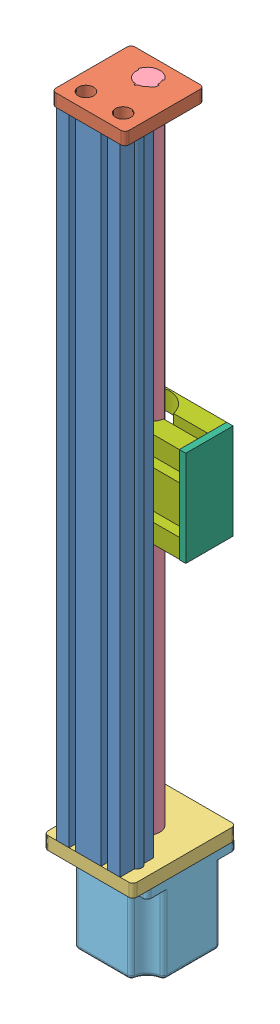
SolidWorks assembly 300mm Rail Assembly.SLDASM, configuration - (file format 12000). Lengths in mm.
Overall size (78.23 468.57 64.85).
8 component instances, 7 part files, 22 mates.
Components (placement in the parent):
- Base-2: Base.SLDPRT [-] at (-95.4137 -223.3019 406.9218) size (43.43 398.46 21.08)
- Free End-1: Free End.SLDPRT [-] at (-52.4877 183.0346 406.9218) x (-1 0 0) z (0 -1 0) size (45.97 49.78 7.87)
- Motor Mount-1: Motor Mount.SLDPRT [-] at (-103.4147 -223.3019 342.1518) x (1 0 0) z (0 -1 0) size (55.88 64.77 8.13)
- Ballscrew-1: Ballscrew.SLDPRT [-] at (-75.4747 183.0346 370.0156) x (-0.837169 0 -0.546944) z (0 -1 0) size (16 16 414.34)
- Motor-1: Motor.SLDPRT [-] at (-103.4147 -285.5319 397.9556) x (1 0 0) z (0 1 0) size (55.88 55.88 73.15)
- Carriage End-1: Carriage End.SLDPRT [-] at (-40.4227 -54.1697 355.1566) x (0 1 0) z (1 0 0) size (59.94 29.72 4.06)
- Carriage End-3: Carriage End.SLDPRT [-] at (-110.5267 5.7743 355.1566) x (0 -1 0) z (-1 0 0) size (59.94 29.72 4.06)
- Carriage1-1: Carriage1.SLDPRT [-] at (-40.4227 -53.9157 384.8746) x (0 1 0) z (-1 0 0) size (59.69 29.72 70.1)
Mates (geometry in assembly coordinates):
- Coincident1: coincident anti-aligned: plane of Base-2 through (-94.1437 175.1606 394.9838) normal (0 1 0); plane of Free End-1 through (-52.4877 175.1606 406.9218) normal (0 -1 0)
- Parallel1: parallel aligned: plane of Base-2 through (-55.5357 175.1606 392.213) normal (1 0 0); plane of Free End-1
- Distance3: distance = 3.048 mm aligned: plane of Base-2 through (-95.4137 175.1606 392.213) normal (-1 0 0); plane of Free End-1 through (-52.4877 175.1606 406.9218) normal (1 0 0)
- Coincident6: coincident anti-aligned: plane of Base-2 through (-94.1437 -223.3019 394.9838) normal (0 -1 0); plane of Motor Mount-1 through (-103.4147 -223.3019 342.1518) normal (0 1 0)
- Coincident7: coincident aligned: plane of Base-2 through (-83.4757 175.1606 406.9218) normal (0 0 1); plane of Motor Mount-1 through (-103.4147 -231.4299 406.9218) normal (0 0 1)
- Distance4: distance = 8.001 mm aligned: plane of Base-2 through (-55.5357 175.1606 392.213) normal (1 0 0); plane of Motor Mount-1 through (-47.5347 -231.4299 342.1518) normal (1 0 0)
- Coincident10: coincident aligned: plane of Free End-1 through (-52.4877 183.0346 406.9218) normal (0 1 0); plane of Ballscrew-1 through (-75.4747 183.0346 370.0156) normal (0 1 0)
- Coincident11: coincident aligned: plane of Base-2 through (-83.4757 175.1606 406.9218) normal (0 0 1); plane of Free End-1 through (-52.4877 175.1606 406.9218) normal (0 0 1)
- Distance5: distance = 3.048 mm aligned: plane of Free End-1 through (-98.4617 175.1606 406.9218) normal (-1 0 0); plane of Base-2 through (-95.4137 175.1606 392.213) normal (-1 0 0)
- Concentric1: concentric anti-aligned: cylinder of Free End-1 through (-75.4747 183.0346 370.0156) axis (0 -1 0) radius 6.985; cylinder of Ballscrew-1 through (-75.4747 -231.3029 370.0156) axis (0 1 0) radius 8.001
- Coincident13: coincident anti-aligned: plane of Motor Mount-1 through (-103.4147 -231.4299 342.1518) normal (0 -1 0); plane of Motor-1 through (-103.4147 -231.4299 342.0756) normal (0 1 0)
- Concentric2: concentric anti-aligned: cylinder of Ballscrew-1 through (-75.4747 -231.3029 370.0156) axis (0 1 0) radius 8.001; cylinder of Motor-1 through (-75.4747 -212.3799 370.0156) axis (0 -1 0) radius 3.175
- Concentric5: concentric anti-aligned: cylinder of Ballscrew-1 through (-75.4747 -231.3029 370.0156) axis (0 1 0) radius 8.001; cylinder of Carriage1-1 through (-75.4747 5.7743 370.0156) axis (0 -1 0) radius 13.97
- Parallel5: parallel anti-aligned: plane of Base-2 through (-83.4757 175.1606 385.8398) normal (0 0 -1); plane of Carriage1-1 through (-110.5267 -35.8817 384.8746) normal (0 0 1)
- Coincident22: coincident aligned: plane of Carriage End-1 through (-36.3587 5.7743 355.1566) normal (0 1 0); plane of Carriage1-1 through (-110.5267 5.7743 367.0946) normal (0 1 0)
- Coincident23: coincident aligned: plane of Carriage End-3 through (-114.5907 5.7743 355.1566) normal (0 1 0); plane of Carriage1-1 through (-110.5267 5.7743 367.0946) normal (0 1 0)
- Coincident24: coincident aligned: plane of Carriage End-3 through (-114.5907 5.7743 355.1566) normal (0 0 -1); plane of Carriage1-1 through (-110.5267 -35.8817 355.1566) normal (0 0 -1)
- Coincident25: coincident anti-aligned: plane of Carriage End-3 through (-110.5267 5.7743 355.1566) normal (1 0 0); plane of Carriage1-1 through (-110.5267 -53.9157 384.8746) normal (-1 0 0)
- Coincident26: coincident aligned: plane of Carriage End-1 through (-36.3587 5.7743 355.1566) normal (0 1 0); plane of Carriage1-1 through (-110.5267 5.7743 367.0946) normal (0 1 0)
- Coincident27: coincident aligned: plane of Carriage End-1 through (-36.3587 -54.1697 355.1566) normal (0 0 -1); plane of Carriage1-1 through (-110.5267 -35.8817 355.1566) normal (0 0 -1)
- Coincident28: coincident anti-aligned: plane of Carriage End-1 through (-40.4227 -54.1697 355.1566) normal (-1 0 0); plane of Carriage1-1 through (-40.4227 -53.9157 384.8746) normal (1 0 0)
- Width1: width aligned: plane of Carriage1-1 through (-110.5267 5.7743 367.0946) normal (0 1 0); plane of Carriage1-1 through (-110.5267 -53.9157 367.0946) normal (0 -1 0); plane of Motor Mount-1 through (-103.4147 -223.3019 342.1518) normal (0 1 0); plane of Free End-1 through (-52.4877 175.1606 406.9218) normal (0 -1 0)
